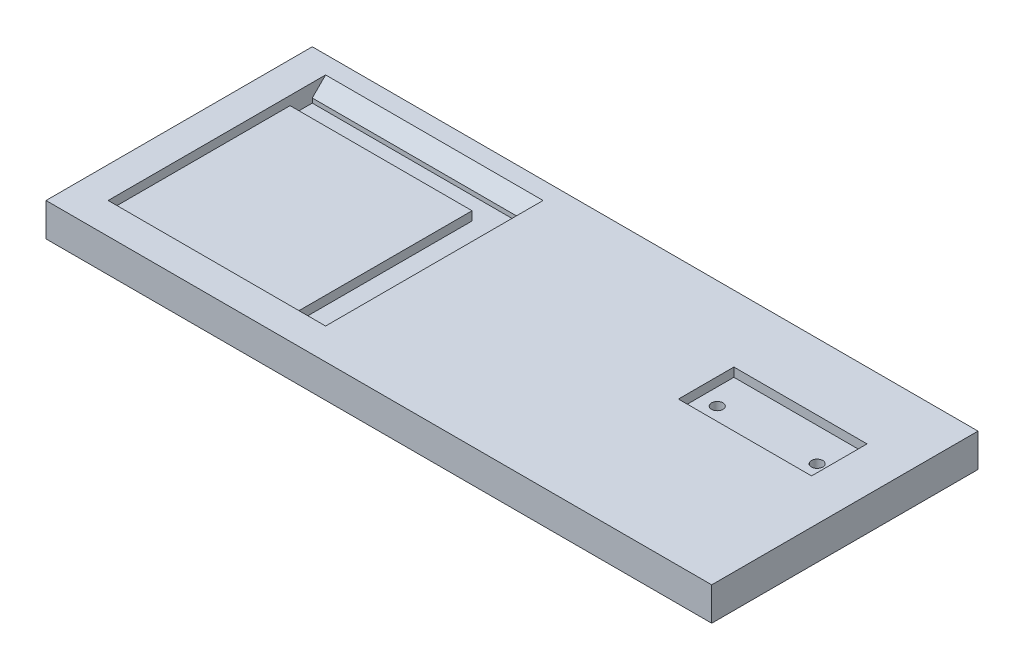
from build123d import *

# Parameters (mm, degrees)
SKETCH1_W                                            = 381
SKETCH1_H                                            = 152.4
BASE_EXTRUDE_DEPTH                                   = 19.05
SKETCH2_W                                            = 76.2
SKETCH2_H                                            = 31.75
MOUNT_CUT_DEPTH                                      = 5.08
CBORE_FOR_1_4_BINDING_HEAD_MACHINE_SCREW_D           = 6.5278
CBORE_FOR_1_4_BINDING_HEAD_MACHINE_SCREW_CBORE_D     = 14.2875
CBORE_FOR_1_4_BINDING_HEAD_MACHINE_SCREW_CBORE_DEPTH = 4.191
SKETCH5_W                                            = 104.14
SKETCH5_H                                            = 104.14
HINGE_CUT_DEPTH                                      = 5.08
HINGE_CUT_2_DEPTH                                    = 10.16
CHAMFER1_SIZE                                        = 7.62


with BuildPart() as part:
    # Sketch1 → Base Extrude (new body)
    with BuildSketch(Plane(origin=(0, 0, 0), x_dir=(1, 0, 0), z_dir=(0, 1, 0))):
        Rectangle(SKETCH1_W, SKETCH1_H)
    extrude(amount=BASE_EXTRUDE_DEPTH)

    # Sketch2 → Mount Cut (cut)
    with BuildSketch(Plane(origin=(0, 19.05, 0), x_dir=(1, 0, 0), z_dir=(0, 1, 0))):
        with Locations((127, 22.225)):
            Rectangle(SKETCH2_W, SKETCH2_H)
    extrude(amount=-MOUNT_CUT_DEPTH, mode=Mode.SUBTRACT)

    # CBORE for 1_4 Binding Head Machine Screw (through all)
    with Locations(Plane(origin=(-3.787872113, 0, 16.840759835), x_dir=(-1, 0, 0), z_dir=(0, -1, 0))):
        with Locations((-159.362872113, 35.890759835), (-102.212872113, 35.890759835)):
            CounterBoreHole(CBORE_FOR_1_4_BINDING_HEAD_MACHINE_SCREW_D / 2, CBORE_FOR_1_4_BINDING_HEAD_MACHINE_SCREW_CBORE_D / 2, CBORE_FOR_1_4_BINDING_HEAD_MACHINE_SCREW_CBORE_DEPTH)

    # Sketch5 → Hinge Cut (cut)
    with BuildSketch(Plane(origin=(0, 19.05, 0), x_dir=(1, 0, 0), z_dir=(0, 1, 0))):
        with Locations((-120.65, -6.35)):
            Rectangle(SKETCH5_W, SKETCH5_H)
    extrude(amount=-HINGE_CUT_DEPTH, mode=Mode.SUBTRACT)

    # Sketch5_3 → Hinge Cut 2 (cut)
    with BuildSketch(Plane(origin=(0, 19.05, 0), x_dir=(1, 0, 0), z_dir=(0, 1, 0))):
        Polygon((-68.58, 45.72), (-68.58, -58.42), (-55.88, -58.42), (-55.88, 58.42), (-172.72, 58.42), (-172.72, 45.72), align=None)
    extrude(amount=-HINGE_CUT_2_DEPTH, mode=Mode.SUBTRACT)

    # Chamfer1
    chamfer1_edges = [part.edges().sort_by_distance(p)[0] for p in [
        (-114.3, 19.05, -58.42),
        (-55.88, 19.05, 0),
    ]]
    chamfer(chamfer1_edges, length=CHAMFER1_SIZE)


solid = part.part
